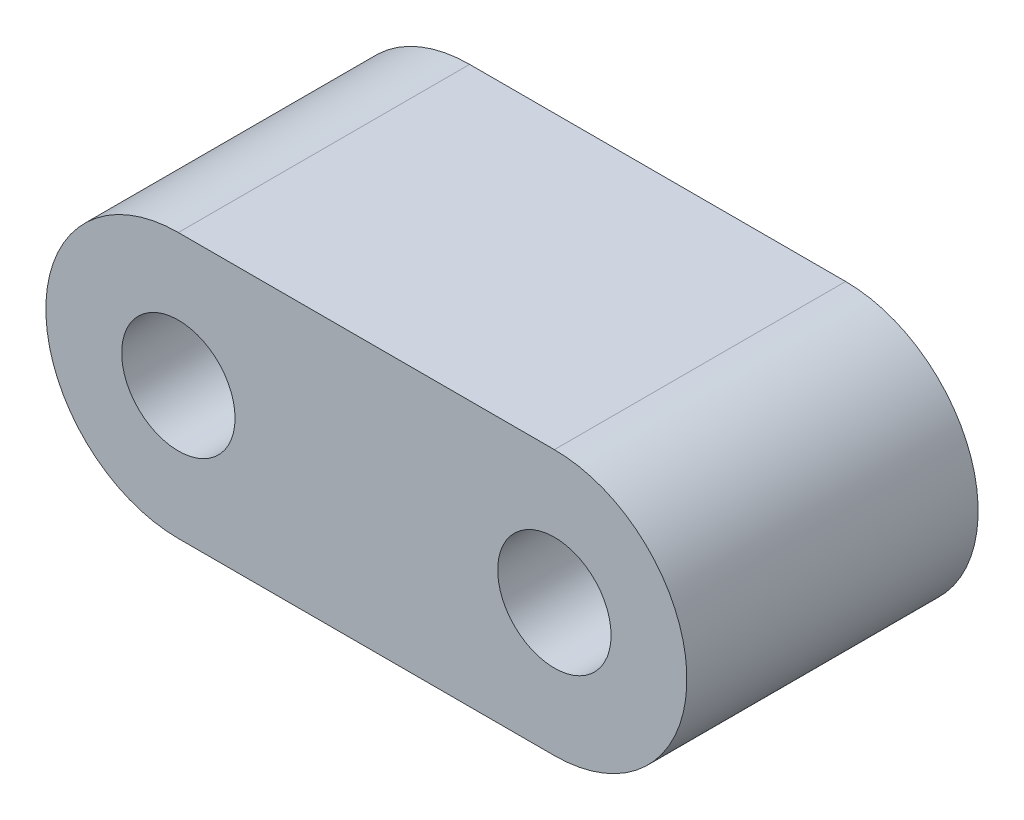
from build123d import *

# Parameters (mm, degrees)
SKETCH1_R      = 1.2065
EXTRUDE1_DEPTH = 3.0988


with BuildPart() as part:
    # Sketch1 → Extrude1 (new, symmetric)
    with BuildSketch(Plane.XY):
        with BuildLine():
            Line((-4.0005, 2.8194), (4.0005, 2.8194))
            ThreePointArc((4.0005, 2.8194), (6.8199, 0), (4.0005, -2.8194))
            Line((4.0005, -2.8194), (-4.0005, -2.8194))
            ThreePointArc((-4.0005, -2.8194), (-6.8199, 0), (-4.0005, 2.8194))
        make_face()
        with Locations((-4.0005, 0)):
            Circle(SKETCH1_R, mode=Mode.SUBTRACT)
        with Locations((4.0005, 0)):
            Circle(SKETCH1_R, mode=Mode.SUBTRACT)
    extrude(amount=EXTRUDE1_DEPTH, both=True)


solid = part.part
